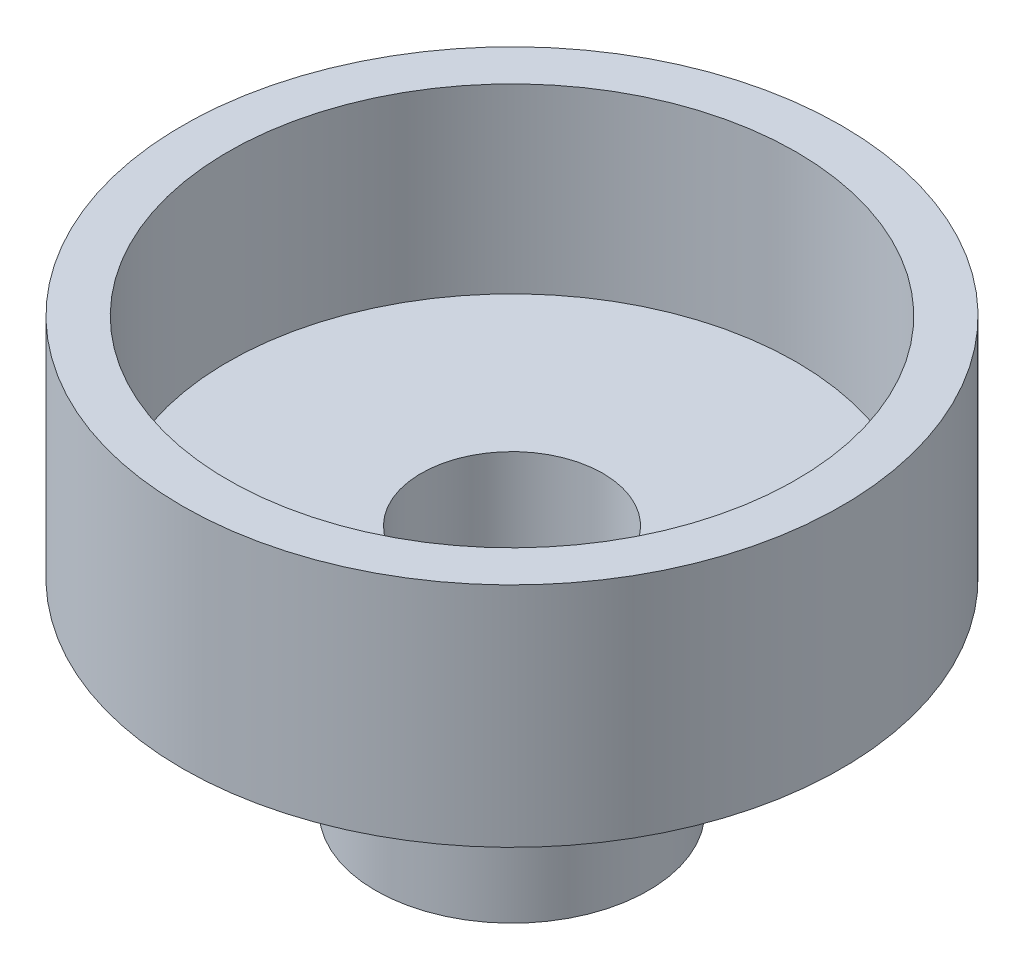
ISO-10303-21;
HEADER;
FILE_DESCRIPTION(('STEP AP214'),'2;1');
FILE_NAME('part.step','',(''),(''),'','','');
FILE_SCHEMA(('AUTOMOTIVE_DESIGN { 1 0 10303 214 1 1 1 1 }'));
ENDSEC;
DATA;
#1=APPLICATION_CONTEXT('core data for automotive mechanical design processes');
#2=APPLICATION_PROTOCOL_DEFINITION('international standard','automotive_design',2000,#1);
#3=PRODUCT_CONTEXT('',#1,'mechanical');
#4=PRODUCT('Part','Part','',(#3));
#5=PRODUCT_RELATED_PRODUCT_CATEGORY('part','',(#4));
#6=PRODUCT_DEFINITION_FORMATION('','',#4);
#7=PRODUCT_DEFINITION_CONTEXT('part definition',#1,'design');
#8=PRODUCT_DEFINITION('design','',#6,#7);
#9=PRODUCT_DEFINITION_SHAPE('','',#8);
#10=(LENGTH_UNIT() NAMED_UNIT(*) SI_UNIT(.MILLI.,.METRE.));
#11=(NAMED_UNIT(*) PLANE_ANGLE_UNIT() SI_UNIT($,.RADIAN.));
#12=(NAMED_UNIT(*) SI_UNIT($,.STERADIAN.) SOLID_ANGLE_UNIT());
#13=UNCERTAINTY_MEASURE_WITH_UNIT(LENGTH_MEASURE(1.E-05),#10,'distance_accuracy_value','');
#14=(GEOMETRIC_REPRESENTATION_CONTEXT(3) GLOBAL_UNCERTAINTY_ASSIGNED_CONTEXT((#13)) GLOBAL_UNIT_ASSIGNED_CONTEXT((#10,
#11,#12)) REPRESENTATION_CONTEXT('',''));
#15=CARTESIAN_POINT('',(0.,0.,0.));
#16=DIRECTION('',(0.,0.,1.));
#17=DIRECTION('',(1.,0.,0.));
#18=AXIS2_PLACEMENT_3D('',#15,#16,#17);
#19=CARTESIAN_POINT('',(62.5,75.1826826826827,0.));
#20=DIRECTION('',(0.,1.,0.));
#21=DIRECTION('',(0.,0.,1.));
#22=AXIS2_PLACEMENT_3D('',#19,#20,#21);
#23=PLANE('',#22);
#24=CARTESIAN_POINT('',(0.,75.1826826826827,0.));
#25=DIRECTION('',(0.,-1.,0.));
#26=DIRECTION('',(0.,0.,-1.));
#27=AXIS2_PLACEMENT_3D('',#24,#25,#26);
#28=CIRCLE('',#27,62.5);
#29=CARTESIAN_POINT('',(0.,75.1826826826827,-62.5));
#30=VERTEX_POINT('',#29);
#31=EDGE_CURVE('E69',#30,#30,#28,.T.);
#32=ORIENTED_EDGE('',*,*,#31,.T.);
#33=EDGE_LOOP('',(#32));
#34=FACE_BOUND('',#33,.T.);
#35=CARTESIAN_POINT('',(0.,75.1826826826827,0.));
#36=DIRECTION('',(0.,-1.,0.));
#37=DIRECTION('',(0.,0.,-1.));
#38=AXIS2_PLACEMENT_3D('',#35,#36,#37);
#39=CIRCLE('',#38,72.5);
#40=CARTESIAN_POINT('',(0.,75.1826826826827,-72.5));
#41=VERTEX_POINT('',#40);
#42=EDGE_CURVE('E10',#41,#41,#39,.T.);
#43=ORIENTED_EDGE('',*,*,#42,.F.);
#44=EDGE_LOOP('',(#43));
#45=FACE_BOUND('',#44,.T.);
#46=ADVANCED_FACE('F29',(#34,#45),#23,.T.);
#47=CARTESIAN_POINT('',(0.,-55.,0.));
#48=DIRECTION('',(0.,-1.,0.));
#49=DIRECTION('',(0.,0.,-1.));
#50=AXIS2_PLACEMENT_3D('',#47,#48,#49);
#51=CYLINDRICAL_SURFACE('',#50,72.5);
#52=ORIENTED_EDGE('',*,*,#42,.T.);
#53=EDGE_LOOP('',(#52));
#54=FACE_BOUND('',#53,.T.);
#55=CARTESIAN_POINT('',(0.,25.1826826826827,0.));
#56=DIRECTION('',(0.,-1.,0.));
#57=DIRECTION('',(0.,0.,-1.));
#58=AXIS2_PLACEMENT_3D('',#55,#56,#57);
#59=CIRCLE('',#58,72.5);
#60=CARTESIAN_POINT('',(0.,25.1826826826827,-72.5));
#61=VERTEX_POINT('',#60);
#62=EDGE_CURVE('E35',#61,#61,#59,.T.);
#63=ORIENTED_EDGE('',*,*,#62,.F.);
#64=EDGE_LOOP('',(#63));
#65=FACE_BOUND('',#64,.T.);
#66=ADVANCED_FACE('F87',(#54,#65),#51,.T.);
#67=CARTESIAN_POINT('',(72.5,25.1826826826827,0.));
#68=DIRECTION('',(0.,-1.,0.));
#69=DIRECTION('',(0.,0.,-1.));
#70=AXIS2_PLACEMENT_3D('',#67,#68,#69);
#71=PLANE('',#70);
#72=ORIENTED_EDGE('',*,*,#62,.T.);
#73=EDGE_LOOP('',(#72));
#74=FACE_BOUND('',#73,.T.);
#75=CARTESIAN_POINT('',(0.,25.1826826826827,0.));
#76=DIRECTION('',(0.,-1.,0.));
#77=DIRECTION('',(0.,0.,-1.));
#78=AXIS2_PLACEMENT_3D('',#75,#76,#77);
#79=CIRCLE('',#78,30.);
#80=CARTESIAN_POINT('',(0.,25.1826826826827,-30.));
#81=VERTEX_POINT('',#80);
#82=EDGE_CURVE('E39',#81,#81,#79,.T.);
#83=ORIENTED_EDGE('',*,*,#82,.F.);
#84=EDGE_LOOP('',(#83));
#85=FACE_BOUND('',#84,.T.);
#86=ADVANCED_FACE('F91',(#74,#85),#71,.T.);
#87=CARTESIAN_POINT('',(0.,-55.,0.));
#88=DIRECTION('',(0.,-1.,0.));
#89=DIRECTION('',(0.,0.,-1.));
#90=AXIS2_PLACEMENT_3D('',#87,#88,#89);
#91=CYLINDRICAL_SURFACE('',#90,30.);
#92=ORIENTED_EDGE('',*,*,#82,.T.);
#93=EDGE_LOOP('',(#92));
#94=FACE_BOUND('',#93,.T.);
#95=CARTESIAN_POINT('',(0.,-19.3173173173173,0.));
#96=DIRECTION('',(0.,-1.,0.));
#97=DIRECTION('',(0.,0.,-1.));
#98=AXIS2_PLACEMENT_3D('',#95,#96,#97);
#99=CIRCLE('',#98,30.);
#100=CARTESIAN_POINT('',(0.,-19.3173173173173,-30.));
#101=VERTEX_POINT('',#100);
#102=EDGE_CURVE('E43',#101,#101,#99,.T.);
#103=ORIENTED_EDGE('',*,*,#102,.F.);
#104=EDGE_LOOP('',(#103));
#105=FACE_BOUND('',#104,.T.);
#106=ADVANCED_FACE('F95',(#94,#105),#91,.T.);
#107=CARTESIAN_POINT('',(20.,-19.3173173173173,0.));
#108=DIRECTION('',(0.,-1.,0.));
#109=DIRECTION('',(0.,0.,-1.));
#110=AXIS2_PLACEMENT_3D('',#107,#108,#109);
#111=PLANE('',#110);
#112=ORIENTED_EDGE('',*,*,#102,.T.);
#113=EDGE_LOOP('',(#112));
#114=FACE_BOUND('',#113,.T.);
#115=CARTESIAN_POINT('',(0.,-19.3173173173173,0.));
#116=DIRECTION('',(0.,-1.,0.));
#117=DIRECTION('',(0.,0.,-1.));
#118=AXIS2_PLACEMENT_3D('',#115,#116,#117);
#119=CIRCLE('',#118,20.);
#120=CARTESIAN_POINT('',(0.,-19.3173173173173,-20.));
#121=VERTEX_POINT('',#120);
#122=EDGE_CURVE('E48',#121,#121,#119,.T.);
#123=ORIENTED_EDGE('',*,*,#122,.F.);
#124=EDGE_LOOP('',(#123));
#125=FACE_BOUND('',#124,.T.);
#126=ADVANCED_FACE('F101',(#114,#125),#111,.T.);
#127=CARTESIAN_POINT('',(0.,-55.,0.));
#128=DIRECTION('',(0.,-1.,0.));
#129=DIRECTION('',(0.,0.,-1.));
#130=AXIS2_PLACEMENT_3D('',#127,#128,#129);
#131=CYLINDRICAL_SURFACE('',#130,20.);
#132=ORIENTED_EDGE('',*,*,#122,.T.);
#133=EDGE_LOOP('',(#132));
#134=FACE_BOUND('',#133,.T.);
#135=CARTESIAN_POINT('',(0.,11.1826826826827,0.));
#136=DIRECTION('',(0.,-1.,0.));
#137=DIRECTION('',(0.,0.,-1.));
#138=AXIS2_PLACEMENT_3D('',#135,#136,#137);
#139=CIRCLE('',#138,20.);
#140=CARTESIAN_POINT('',(0.,11.1826826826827,-20.));
#141=VERTEX_POINT('',#140);
#142=EDGE_CURVE('E51',#141,#141,#139,.T.);
#143=ORIENTED_EDGE('',*,*,#142,.F.);
#144=EDGE_LOOP('',(#143));
#145=FACE_BOUND('',#144,.T.);
#146=ADVANCED_FACE('F105',(#134,#145),#131,.F.);
#147=CARTESIAN_POINT('',(21.5,11.1826826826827,0.));
#148=DIRECTION('',(0.,1.,0.));
#149=DIRECTION('',(0.,0.,1.));
#150=AXIS2_PLACEMENT_3D('',#147,#148,#149);
#151=PLANE('',#150);
#152=ORIENTED_EDGE('',*,*,#142,.T.);
#153=EDGE_LOOP('',(#152));
#154=FACE_BOUND('',#153,.T.);
#155=CARTESIAN_POINT('',(0.,11.1826826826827,0.));
#156=DIRECTION('',(0.,-1.,0.));
#157=DIRECTION('',(0.,0.,-1.));
#158=AXIS2_PLACEMENT_3D('',#155,#156,#157);
#159=CIRCLE('',#158,21.5);
#160=CARTESIAN_POINT('',(0.,11.1826826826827,-21.5));
#161=VERTEX_POINT('',#160);
#162=EDGE_CURVE('E54',#161,#161,#159,.T.);
#163=ORIENTED_EDGE('',*,*,#162,.F.);
#164=EDGE_LOOP('',(#163));
#165=FACE_BOUND('',#164,.T.);
#166=ADVANCED_FACE('F109',(#154,#165),#151,.T.);
#167=CARTESIAN_POINT('',(0.,-55.,0.));
#168=DIRECTION('',(0.,-1.,0.));
#169=DIRECTION('',(0.,0.,-1.));
#170=AXIS2_PLACEMENT_3D('',#167,#168,#169);
#171=CYLINDRICAL_SURFACE('',#170,21.5);
#172=ORIENTED_EDGE('',*,*,#162,.T.);
#173=EDGE_LOOP('',(#172));
#174=FACE_BOUND('',#173,.T.);
#175=CARTESIAN_POINT('',(0.,12.6826826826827,0.));
#176=DIRECTION('',(0.,-1.,0.));
#177=DIRECTION('',(0.,0.,-1.));
#178=AXIS2_PLACEMENT_3D('',#175,#176,#177);
#179=CIRCLE('',#178,21.5);
#180=CARTESIAN_POINT('',(0.,12.6826826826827,-21.5));
#181=VERTEX_POINT('',#180);
#182=EDGE_CURVE('E57',#181,#181,#179,.T.);
#183=ORIENTED_EDGE('',*,*,#182,.F.);
#184=EDGE_LOOP('',(#183));
#185=FACE_BOUND('',#184,.T.);
#186=ADVANCED_FACE('F113',(#174,#185),#171,.F.);
#187=CARTESIAN_POINT('',(20.,12.6826826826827,0.));
#188=DIRECTION('',(0.,-1.,0.));
#189=DIRECTION('',(0.,0.,-1.));
#190=AXIS2_PLACEMENT_3D('',#187,#188,#189);
#191=PLANE('',#190);
#192=ORIENTED_EDGE('',*,*,#182,.T.);
#193=EDGE_LOOP('',(#192));
#194=FACE_BOUND('',#193,.T.);
#195=CARTESIAN_POINT('',(0.,12.6826826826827,0.));
#196=DIRECTION('',(0.,-1.,0.));
#197=DIRECTION('',(0.,0.,-1.));
#198=AXIS2_PLACEMENT_3D('',#195,#196,#197);
#199=CIRCLE('',#198,20.);
#200=CARTESIAN_POINT('',(0.,12.6826826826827,-20.));
#201=VERTEX_POINT('',#200);
#202=EDGE_CURVE('E60',#201,#201,#199,.T.);
#203=ORIENTED_EDGE('',*,*,#202,.F.);
#204=EDGE_LOOP('',(#203));
#205=FACE_BOUND('',#204,.T.);
#206=ADVANCED_FACE('F117',(#194,#205),#191,.T.);
#207=CARTESIAN_POINT('',(0.,-55.,0.));
#208=DIRECTION('',(0.,-1.,0.));
#209=DIRECTION('',(0.,0.,-1.));
#210=AXIS2_PLACEMENT_3D('',#207,#208,#209);
#211=CYLINDRICAL_SURFACE('',#210,20.);
#212=ORIENTED_EDGE('',*,*,#202,.T.);
#213=EDGE_LOOP('',(#212));
#214=FACE_BOUND('',#213,.T.);
#215=CARTESIAN_POINT('',(0.,35.1826826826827,0.));
#216=DIRECTION('',(0.,-1.,0.));
#217=DIRECTION('',(0.,0.,-1.));
#218=AXIS2_PLACEMENT_3D('',#215,#216,#217);
#219=CIRCLE('',#218,20.);
#220=CARTESIAN_POINT('',(0.,35.1826826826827,-20.));
#221=VERTEX_POINT('',#220);
#222=EDGE_CURVE('E63',#221,#221,#219,.T.);
#223=ORIENTED_EDGE('',*,*,#222,.F.);
#224=EDGE_LOOP('',(#223));
#225=FACE_BOUND('',#224,.T.);
#226=ADVANCED_FACE('F83',(#214,#225),#211,.F.);
#227=CARTESIAN_POINT('',(62.5,35.1826826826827,0.));
#228=DIRECTION('',(0.,1.,0.));
#229=DIRECTION('',(0.,0.,1.));
#230=AXIS2_PLACEMENT_3D('',#227,#228,#229);
#231=PLANE('',#230);
#232=ORIENTED_EDGE('',*,*,#222,.T.);
#233=EDGE_LOOP('',(#232));
#234=FACE_BOUND('',#233,.T.);
#235=CARTESIAN_POINT('',(0.,35.1826826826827,0.));
#236=DIRECTION('',(0.,-1.,0.));
#237=DIRECTION('',(0.,0.,-1.));
#238=AXIS2_PLACEMENT_3D('',#235,#236,#237);
#239=CIRCLE('',#238,62.5);
#240=CARTESIAN_POINT('',(0.,35.1826826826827,-62.5));
#241=VERTEX_POINT('',#240);
#242=EDGE_CURVE('E66',#241,#241,#239,.T.);
#243=ORIENTED_EDGE('',*,*,#242,.F.);
#244=EDGE_LOOP('',(#243));
#245=FACE_BOUND('',#244,.T.);
#246=ADVANCED_FACE('F77',(#234,#245),#231,.T.);
#247=CARTESIAN_POINT('',(0.,-55.,0.));
#248=DIRECTION('',(0.,-1.,0.));
#249=DIRECTION('',(0.,0.,-1.));
#250=AXIS2_PLACEMENT_3D('',#247,#248,#249);
#251=CYLINDRICAL_SURFACE('',#250,62.5);
#252=ORIENTED_EDGE('',*,*,#242,.T.);
#253=EDGE_LOOP('',(#252));
#254=FACE_BOUND('',#253,.T.);
#255=ORIENTED_EDGE('',*,*,#31,.F.);
#256=EDGE_LOOP('',(#255));
#257=FACE_BOUND('',#256,.T.);
#258=ADVANCED_FACE('F75',(#254,#257),#251,.F.);
#259=CLOSED_SHELL('',(#46,#66,#86,#106,#126,#146,#166,#186,#206,#226,#246,#258));
#260=MANIFOLD_SOLID_BREP('B2',#259);
#261=ADVANCED_BREP_SHAPE_REPRESENTATION('',(#18,#260),#14);
#262=SHAPE_DEFINITION_REPRESENTATION(#9,#261);
ENDSEC;
END-ISO-10303-21;
